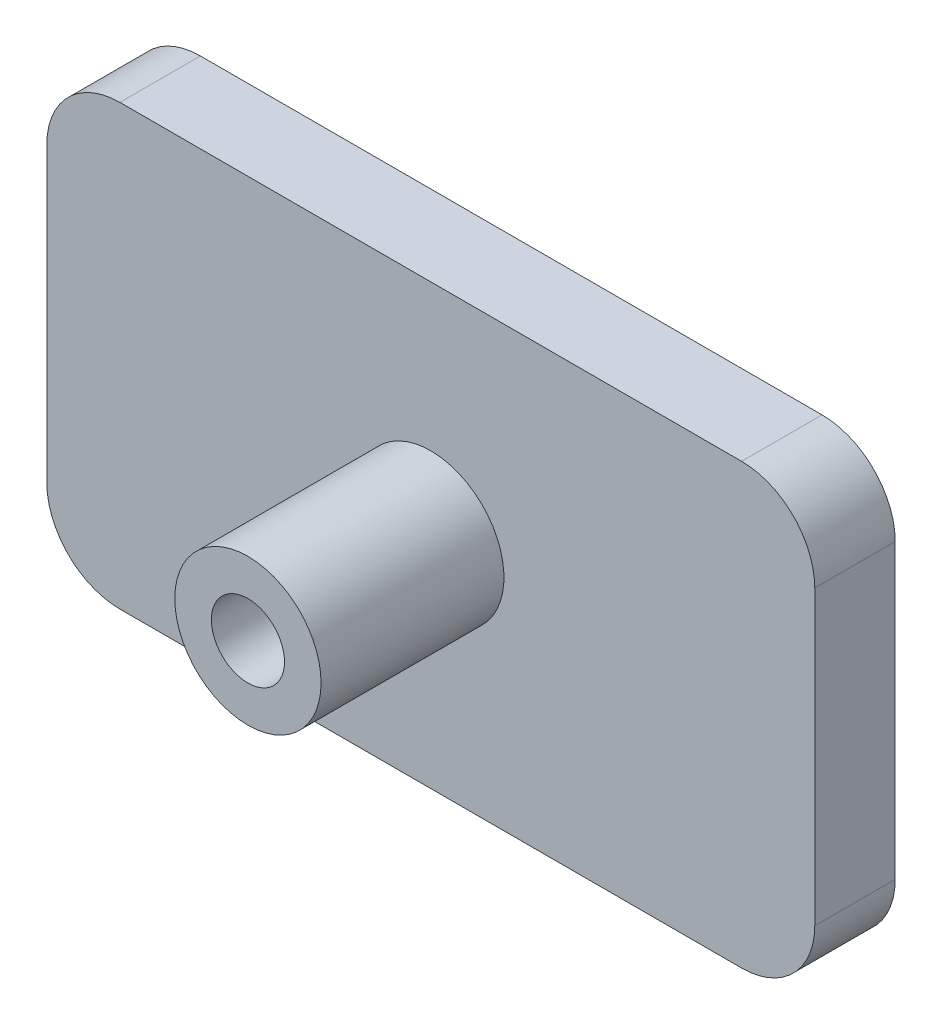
from build123d import *

# Parameters (mm, degrees)
ESQUISSE4_R             = 1
BOSS_EXTRU_3_DEPTH      = 2.2
ENL_V_MAT_EXTRU_2_DEPTH = 1.1
ESQUISSE6_R             = 2
ESQUISSE6_R_2           = 1
BOSS_EXTRU_4_DEPTH      = 5


with BuildPart() as part:
    # Esquisse4 → Boss.-Extru.3 (new body)
    with BuildSketch(Plane.XY):
        with BuildLine():
            Line((-8.5, -6), (8.5, -6))
            ThreePointArc((8.5, -6), (9.914213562, -5.414213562), (10.5, -4))
            Line((10.5, -4), (10.5, 4))
            ThreePointArc((10.5, 4), (9.914213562, 5.414213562), (8.5, 6))
            Line((8.5, 6), (-8.5, 6))
            ThreePointArc((-8.5, 6), (-9.914213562, 5.414213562), (-10.5, 4))
            Line((-10.5, 4), (-10.5, -4))
            ThreePointArc((-10.5, -4), (-9.914213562, -5.414213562), (-8.5, -6))
        make_face()
        Circle(ESQUISSE4_R, mode=Mode.SUBTRACT)
    extrude(amount=BOSS_EXTRU_3_DEPTH)

    # Esquisse5 → Enl_v. mat.-Extru.2 (cut)
    with BuildSketch(Plane(origin=(0, 0, 0), x_dir=(-1, 0, 0), z_dir=(0, 0, -1))):
        with BuildLine():
            Line((-8.5, -5), (8.5, -5))
            ThreePointArc((8.5, -5), (9.207106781, -4.707106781), (9.5, -4))
            Line((9.5, -4), (9.5, 4))
            ThreePointArc((9.5, 4), (9.207106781, 4.707106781), (8.5, 5))
            Line((8.5, 5), (-8.5, 5))
            ThreePointArc((-8.5, 5), (-9.207106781, 4.707106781), (-9.5, 4))
            Line((-9.5, 4), (-9.5, -4))
            ThreePointArc((-9.5, -4), (-9.207106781, -4.707106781), (-8.5, -5))
        make_face()
    extrude(amount=-ENL_V_MAT_EXTRU_2_DEPTH, mode=Mode.SUBTRACT)

    # Esquisse6 → Boss.-Extru.4 (add)
    with BuildSketch(Plane.XY.offset(2.2)):
        with Locations(Location((0, 0, 0), (0, 0, 180))):
            Circle(ESQUISSE6_R)
        Circle(ESQUISSE6_R_2, mode=Mode.SUBTRACT)
    extrude(amount=BOSS_EXTRU_4_DEPTH)


solid = part.part
